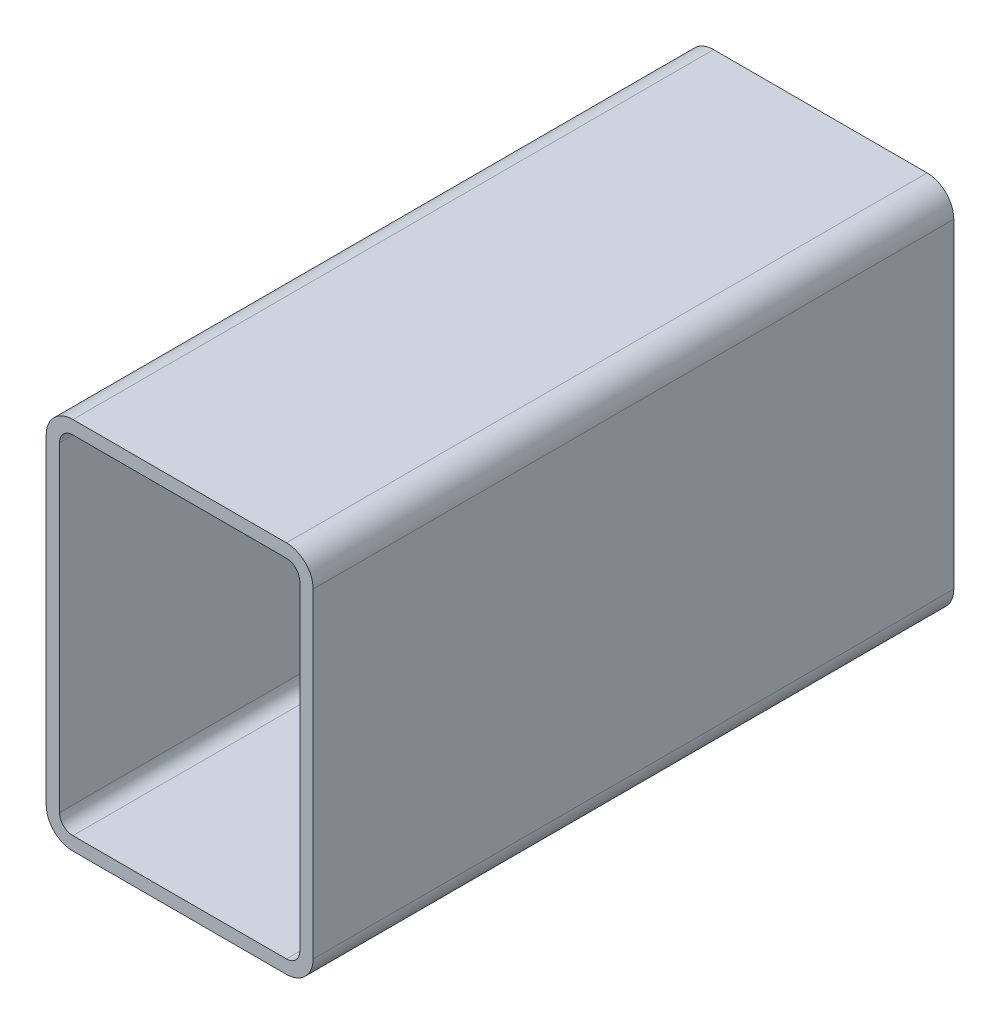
ISO-10303-21;
HEADER;
FILE_DESCRIPTION(('STEP AP214'),'2;1');
FILE_NAME('part.step','',(''),(''),'','','');
FILE_SCHEMA(('AUTOMOTIVE_DESIGN { 1 0 10303 214 1 1 1 1 }'));
ENDSEC;
DATA;
#1=APPLICATION_CONTEXT('core data for automotive mechanical design processes');
#2=APPLICATION_PROTOCOL_DEFINITION('international standard','automotive_design',2000,#1);
#3=PRODUCT_CONTEXT('',#1,'mechanical');
#4=PRODUCT('Part','Part','',(#3));
#5=PRODUCT_RELATED_PRODUCT_CATEGORY('part','',(#4));
#6=PRODUCT_DEFINITION_FORMATION('','',#4);
#7=PRODUCT_DEFINITION_CONTEXT('part definition',#1,'design');
#8=PRODUCT_DEFINITION('design','',#6,#7);
#9=PRODUCT_DEFINITION_SHAPE('','',#8);
#10=(LENGTH_UNIT() NAMED_UNIT(*) SI_UNIT(.MILLI.,.METRE.));
#11=(NAMED_UNIT(*) PLANE_ANGLE_UNIT() SI_UNIT($,.RADIAN.));
#12=(NAMED_UNIT(*) SI_UNIT($,.STERADIAN.) SOLID_ANGLE_UNIT());
#13=UNCERTAINTY_MEASURE_WITH_UNIT(LENGTH_MEASURE(1.E-05),#10,'distance_accuracy_value','');
#14=(GEOMETRIC_REPRESENTATION_CONTEXT(3) GLOBAL_UNCERTAINTY_ASSIGNED_CONTEXT((#13)) GLOBAL_UNIT_ASSIGNED_CONTEXT((#10,
#11,#12)) REPRESENTATION_CONTEXT('',''));
#15=CARTESIAN_POINT('',(0.,0.,0.));
#16=DIRECTION('',(0.,0.,1.));
#17=DIRECTION('',(1.,0.,0.));
#18=AXIS2_PLACEMENT_3D('',#15,#16,#17);
#19=CARTESIAN_POINT('',(13.5612396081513,167.089039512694,304.8));
#20=DIRECTION('',(0.,0.,1.));
#21=DIRECTION('',(1.,0.,0.));
#22=AXIS2_PLACEMENT_3D('',#19,#20,#21);
#23=PLANE('',#22);
#24=CARTESIAN_POINT('',(13.5612396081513,167.089039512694,304.8));
#25=DIRECTION('',(0.,0.,1.));
#26=DIRECTION('',(1.,0.,0.));
#27=AXIS2_PLACEMENT_3D('',#24,#25,#26);
#28=CIRCLE('',#27,12.7);
#29=CARTESIAN_POINT('',(13.5612396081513,179.789039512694,304.8));
#30=VERTEX_POINT('',#29);
#31=CARTESIAN_POINT('',(0.8612396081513,167.089039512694,304.8));
#32=VERTEX_POINT('',#31);
#33=EDGE_CURVE('E211',#30,#32,#28,.T.);
#34=ORIENTED_EDGE('',*,*,#33,.T.);
#35=DIRECTION('',(0.,-1.,0.));
#36=VECTOR('',#35,1.);
#37=CARTESIAN_POINT('',(0.8612396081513,14.6890395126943,304.8));
#38=LINE('',#37,#36);
#39=CARTESIAN_POINT('',(0.8612396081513,14.6890395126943,304.8));
#40=VERTEX_POINT('',#39);
#41=EDGE_CURVE('E214',#32,#40,#38,.T.);
#42=ORIENTED_EDGE('',*,*,#41,.T.);
#43=CARTESIAN_POINT('',(13.5612396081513,14.6890395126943,304.8));
#44=DIRECTION('',(0.,0.,1.));
#45=DIRECTION('',(1.,0.,0.));
#46=AXIS2_PLACEMENT_3D('',#43,#44,#45);
#47=CIRCLE('',#46,12.7);
#48=CARTESIAN_POINT('',(13.5612396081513,1.98903951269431,304.8));
#49=VERTEX_POINT('',#48);
#50=EDGE_CURVE('E217',#40,#49,#47,.T.);
#51=ORIENTED_EDGE('',*,*,#50,.T.);
#52=DIRECTION('',(1.,0.,0.));
#53=VECTOR('',#52,1.);
#54=CARTESIAN_POINT('',(115.161239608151,1.98903951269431,304.8));
#55=LINE('',#54,#53);
#56=CARTESIAN_POINT('',(115.161239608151,1.98903951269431,304.8));
#57=VERTEX_POINT('',#56);
#58=EDGE_CURVE('E219',#49,#57,#55,.T.);
#59=ORIENTED_EDGE('',*,*,#58,.T.);
#60=CARTESIAN_POINT('',(115.161239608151,14.6890395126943,304.8));
#61=DIRECTION('',(0.,0.,1.));
#62=DIRECTION('',(1.,0.,0.));
#63=AXIS2_PLACEMENT_3D('',#60,#61,#62);
#64=CIRCLE('',#63,12.7);
#65=CARTESIAN_POINT('',(127.861239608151,14.6890395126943,304.8));
#66=VERTEX_POINT('',#65);
#67=EDGE_CURVE('E221',#57,#66,#64,.T.);
#68=ORIENTED_EDGE('',*,*,#67,.T.);
#69=DIRECTION('',(0.,1.,0.));
#70=VECTOR('',#69,1.);
#71=CARTESIAN_POINT('',(127.861239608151,167.089039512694,304.8));
#72=LINE('',#71,#70);
#73=CARTESIAN_POINT('',(127.861239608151,167.089039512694,304.8));
#74=VERTEX_POINT('',#73);
#75=EDGE_CURVE('E223',#66,#74,#72,.T.);
#76=ORIENTED_EDGE('',*,*,#75,.T.);
#77=CARTESIAN_POINT('',(115.161239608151,167.089039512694,304.8));
#78=DIRECTION('',(0.,0.,1.));
#79=DIRECTION('',(1.,0.,0.));
#80=AXIS2_PLACEMENT_3D('',#77,#78,#79);
#81=CIRCLE('',#80,12.7);
#82=CARTESIAN_POINT('',(115.161239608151,179.789039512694,304.8));
#83=VERTEX_POINT('',#82);
#84=EDGE_CURVE('E225',#74,#83,#81,.T.);
#85=ORIENTED_EDGE('',*,*,#84,.T.);
#86=DIRECTION('',(-1.,0.,0.));
#87=VECTOR('',#86,1.);
#88=CARTESIAN_POINT('',(13.5612396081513,179.789039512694,304.8));
#89=LINE('',#88,#87);
#90=EDGE_CURVE('E227',#83,#30,#89,.T.);
#91=ORIENTED_EDGE('',*,*,#90,.T.);
#92=EDGE_LOOP('',(#34,#42,#51,#59,#68,#76,#85,#91));
#93=FACE_BOUND('',#92,.T.);
#94=DIRECTION('',(0.,-1.,0.));
#95=VECTOR('',#94,1.);
#96=CARTESIAN_POINT('',(7.2112396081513,14.6890395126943,304.8));
#97=LINE('',#96,#95);
#98=CARTESIAN_POINT('',(7.2112396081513,167.089039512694,304.8));
#99=VERTEX_POINT('',#98);
#100=CARTESIAN_POINT('',(7.2112396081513,14.6890395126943,304.8));
#101=VERTEX_POINT('',#100);
#102=EDGE_CURVE('E154',#99,#101,#97,.T.);
#103=ORIENTED_EDGE('',*,*,#102,.F.);
#104=CARTESIAN_POINT('',(13.5612396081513,167.089039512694,304.8));
#105=DIRECTION('',(0.,0.,1.));
#106=DIRECTION('',(1.,0.,0.));
#107=AXIS2_PLACEMENT_3D('',#104,#105,#106);
#108=CIRCLE('',#107,6.34999999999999);
#109=CARTESIAN_POINT('',(13.5612396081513,173.439039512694,304.8));
#110=VERTEX_POINT('',#109);
#111=EDGE_CURVE('E146',#110,#99,#108,.T.);
#112=ORIENTED_EDGE('',*,*,#111,.F.);
#113=DIRECTION('',(-1.,0.,0.));
#114=VECTOR('',#113,1.);
#115=CARTESIAN_POINT('',(13.5612396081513,173.439039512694,304.8));
#116=LINE('',#115,#114);
#117=CARTESIAN_POINT('',(115.161239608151,173.439039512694,304.8));
#118=VERTEX_POINT('',#117);
#119=EDGE_CURVE('E179',#118,#110,#116,.T.);
#120=ORIENTED_EDGE('',*,*,#119,.F.);
#121=CARTESIAN_POINT('',(115.161239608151,167.089039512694,304.8));
#122=DIRECTION('',(0.,0.,1.));
#123=DIRECTION('',(1.,0.,0.));
#124=AXIS2_PLACEMENT_3D('',#121,#122,#123);
#125=CIRCLE('',#124,6.35);
#126=CARTESIAN_POINT('',(121.511239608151,167.089039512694,304.8));
#127=VERTEX_POINT('',#126);
#128=EDGE_CURVE('E177',#127,#118,#125,.T.);
#129=ORIENTED_EDGE('',*,*,#128,.F.);
#130=DIRECTION('',(0.,1.,0.));
#131=VECTOR('',#130,1.);
#132=CARTESIAN_POINT('',(121.511239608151,167.089039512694,304.8));
#133=LINE('',#132,#131);
#134=CARTESIAN_POINT('',(121.511239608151,14.6890395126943,304.8));
#135=VERTEX_POINT('',#134);
#136=EDGE_CURVE('E175',#135,#127,#133,.T.);
#137=ORIENTED_EDGE('',*,*,#136,.F.);
#138=CARTESIAN_POINT('',(115.161239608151,14.6890395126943,304.8));
#139=DIRECTION('',(0.,0.,1.));
#140=DIRECTION('',(1.,0.,0.));
#141=AXIS2_PLACEMENT_3D('',#138,#139,#140);
#142=CIRCLE('',#141,6.35000000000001);
#143=CARTESIAN_POINT('',(115.161239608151,8.3390395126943,304.8));
#144=VERTEX_POINT('',#143);
#145=EDGE_CURVE('E173',#144,#135,#142,.T.);
#146=ORIENTED_EDGE('',*,*,#145,.F.);
#147=DIRECTION('',(1.,0.,0.));
#148=VECTOR('',#147,1.);
#149=CARTESIAN_POINT('',(115.161239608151,8.33903951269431,304.8));
#150=LINE('',#149,#148);
#151=CARTESIAN_POINT('',(13.5612396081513,8.33903951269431,304.8));
#152=VERTEX_POINT('',#151);
#153=EDGE_CURVE('E169',#152,#144,#150,.T.);
#154=ORIENTED_EDGE('',*,*,#153,.F.);
#155=CARTESIAN_POINT('',(13.5612396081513,14.6890395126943,304.8));
#156=DIRECTION('',(0.,0.,1.));
#157=DIRECTION('',(1.,0.,0.));
#158=AXIS2_PLACEMENT_3D('',#155,#156,#157);
#159=CIRCLE('',#158,6.35);
#160=EDGE_CURVE('E167',#101,#152,#159,.T.);
#161=ORIENTED_EDGE('',*,*,#160,.F.);
#162=EDGE_LOOP('',(#103,#112,#120,#129,#137,#146,#154,#161));
#163=FACE_BOUND('',#162,.T.);
#164=ADVANCED_FACE('F33',(#93,#163),#23,.T.);
#165=CARTESIAN_POINT('',(13.5612396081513,167.089039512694,0.));
#166=DIRECTION('',(0.,0.,1.));
#167=DIRECTION('',(1.,0.,0.));
#168=AXIS2_PLACEMENT_3D('',#165,#166,#167);
#169=PLANE('',#168);
#170=CARTESIAN_POINT('',(13.5612396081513,167.089039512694,0.));
#171=DIRECTION('',(0.,0.,1.));
#172=DIRECTION('',(1.,0.,0.));
#173=AXIS2_PLACEMENT_3D('',#170,#171,#172);
#174=CIRCLE('',#173,12.7);
#175=CARTESIAN_POINT('',(13.5612396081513,179.789039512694,0.));
#176=VERTEX_POINT('',#175);
#177=CARTESIAN_POINT('',(0.8612396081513,167.089039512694,0.));
#178=VERTEX_POINT('',#177);
#179=EDGE_CURVE('E162',#176,#178,#174,.T.);
#180=ORIENTED_EDGE('',*,*,#179,.F.);
#181=DIRECTION('',(-1.,0.,0.));
#182=VECTOR('',#181,1.);
#183=CARTESIAN_POINT('',(13.5612396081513,179.789039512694,0.));
#184=LINE('',#183,#182);
#185=CARTESIAN_POINT('',(115.161239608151,179.789039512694,0.));
#186=VERTEX_POINT('',#185);
#187=EDGE_CURVE('E215',#186,#176,#184,.T.);
#188=ORIENTED_EDGE('',*,*,#187,.F.);
#189=CARTESIAN_POINT('',(115.161239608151,167.089039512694,0.));
#190=DIRECTION('',(0.,0.,1.));
#191=DIRECTION('',(1.,0.,0.));
#192=AXIS2_PLACEMENT_3D('',#189,#190,#191);
#193=CIRCLE('',#192,12.7);
#194=CARTESIAN_POINT('',(127.861239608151,167.089039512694,0.));
#195=VERTEX_POINT('',#194);
#196=EDGE_CURVE('E242',#195,#186,#193,.T.);
#197=ORIENTED_EDGE('',*,*,#196,.F.);
#198=DIRECTION('',(0.,1.,0.));
#199=VECTOR('',#198,1.);
#200=CARTESIAN_POINT('',(127.861239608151,167.089039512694,0.));
#201=LINE('',#200,#199);
#202=CARTESIAN_POINT('',(127.861239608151,14.6890395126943,0.));
#203=VERTEX_POINT('',#202);
#204=EDGE_CURVE('E240',#203,#195,#201,.T.);
#205=ORIENTED_EDGE('',*,*,#204,.F.);
#206=CARTESIAN_POINT('',(115.161239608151,14.6890395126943,0.));
#207=DIRECTION('',(0.,0.,1.));
#208=DIRECTION('',(1.,0.,0.));
#209=AXIS2_PLACEMENT_3D('',#206,#207,#208);
#210=CIRCLE('',#209,12.7);
#211=CARTESIAN_POINT('',(115.161239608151,1.98903951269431,0.));
#212=VERTEX_POINT('',#211);
#213=EDGE_CURVE('E238',#212,#203,#210,.T.);
#214=ORIENTED_EDGE('',*,*,#213,.F.);
#215=DIRECTION('',(1.,0.,0.));
#216=VECTOR('',#215,1.);
#217=CARTESIAN_POINT('',(115.161239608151,1.98903951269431,0.));
#218=LINE('',#217,#216);
#219=CARTESIAN_POINT('',(13.5612396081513,1.98903951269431,0.));
#220=VERTEX_POINT('',#219);
#221=EDGE_CURVE('E236',#220,#212,#218,.T.);
#222=ORIENTED_EDGE('',*,*,#221,.F.);
#223=CARTESIAN_POINT('',(13.5612396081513,14.6890395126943,0.));
#224=DIRECTION('',(0.,0.,1.));
#225=DIRECTION('',(1.,0.,0.));
#226=AXIS2_PLACEMENT_3D('',#223,#224,#225);
#227=CIRCLE('',#226,12.7);
#228=CARTESIAN_POINT('',(0.8612396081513,14.6890395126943,0.));
#229=VERTEX_POINT('',#228);
#230=EDGE_CURVE('E234',#229,#220,#227,.T.);
#231=ORIENTED_EDGE('',*,*,#230,.F.);
#232=DIRECTION('',(0.,-1.,0.));
#233=VECTOR('',#232,1.);
#234=CARTESIAN_POINT('',(0.8612396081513,14.6890395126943,0.));
#235=LINE('',#234,#233);
#236=EDGE_CURVE('E232',#178,#229,#235,.T.);
#237=ORIENTED_EDGE('',*,*,#236,.F.);
#238=EDGE_LOOP('',(#180,#188,#197,#205,#214,#222,#231,#237));
#239=FACE_BOUND('',#238,.T.);
#240=CARTESIAN_POINT('',(13.5612396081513,167.089039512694,0.));
#241=DIRECTION('',(0.,0.,1.));
#242=DIRECTION('',(1.,0.,0.));
#243=AXIS2_PLACEMENT_3D('',#240,#241,#242);
#244=CIRCLE('',#243,6.34999999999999);
#245=CARTESIAN_POINT('',(13.5612396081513,173.439039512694,0.));
#246=VERTEX_POINT('',#245);
#247=CARTESIAN_POINT('',(7.2112396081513,167.089039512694,0.));
#248=VERTEX_POINT('',#247);
#249=EDGE_CURVE('E56',#246,#248,#244,.T.);
#250=ORIENTED_EDGE('',*,*,#249,.T.);
#251=DIRECTION('',(0.,-1.,0.));
#252=VECTOR('',#251,1.);
#253=CARTESIAN_POINT('',(7.2112396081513,14.6890395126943,0.));
#254=LINE('',#253,#252);
#255=CARTESIAN_POINT('',(7.2112396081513,14.6890395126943,0.));
#256=VERTEX_POINT('',#255);
#257=EDGE_CURVE('E161',#248,#256,#254,.T.);
#258=ORIENTED_EDGE('',*,*,#257,.T.);
#259=CARTESIAN_POINT('',(13.5612396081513,14.6890395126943,0.));
#260=DIRECTION('',(0.,0.,1.));
#261=DIRECTION('',(1.,0.,0.));
#262=AXIS2_PLACEMENT_3D('',#259,#260,#261);
#263=CIRCLE('',#262,6.35);
#264=CARTESIAN_POINT('',(13.5612396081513,8.33903951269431,0.));
#265=VERTEX_POINT('',#264);
#266=EDGE_CURVE('E183',#256,#265,#263,.T.);
#267=ORIENTED_EDGE('',*,*,#266,.T.);
#268=DIRECTION('',(1.,0.,0.));
#269=VECTOR('',#268,1.);
#270=CARTESIAN_POINT('',(115.161239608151,8.33903951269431,0.));
#271=LINE('',#270,#269);
#272=CARTESIAN_POINT('',(115.161239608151,8.3390395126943,0.));
#273=VERTEX_POINT('',#272);
#274=EDGE_CURVE('E186',#265,#273,#271,.T.);
#275=ORIENTED_EDGE('',*,*,#274,.T.);
#276=CARTESIAN_POINT('',(115.161239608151,14.6890395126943,0.));
#277=DIRECTION('',(0.,0.,1.));
#278=DIRECTION('',(1.,0.,0.));
#279=AXIS2_PLACEMENT_3D('',#276,#277,#278);
#280=CIRCLE('',#279,6.35000000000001);
#281=CARTESIAN_POINT('',(121.511239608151,14.6890395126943,0.));
#282=VERTEX_POINT('',#281);
#283=EDGE_CURVE('E189',#273,#282,#280,.T.);
#284=ORIENTED_EDGE('',*,*,#283,.T.);
#285=DIRECTION('',(0.,1.,0.));
#286=VECTOR('',#285,1.);
#287=CARTESIAN_POINT('',(121.511239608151,167.089039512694,0.));
#288=LINE('',#287,#286);
#289=CARTESIAN_POINT('',(121.511239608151,167.089039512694,0.));
#290=VERTEX_POINT('',#289);
#291=EDGE_CURVE('E192',#282,#290,#288,.T.);
#292=ORIENTED_EDGE('',*,*,#291,.T.);
#293=CARTESIAN_POINT('',(115.161239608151,167.089039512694,0.));
#294=DIRECTION('',(0.,0.,1.));
#295=DIRECTION('',(1.,0.,0.));
#296=AXIS2_PLACEMENT_3D('',#293,#294,#295);
#297=CIRCLE('',#296,6.35);
#298=CARTESIAN_POINT('',(115.161239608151,173.439039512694,0.));
#299=VERTEX_POINT('',#298);
#300=EDGE_CURVE('E195',#290,#299,#297,.T.);
#301=ORIENTED_EDGE('',*,*,#300,.T.);
#302=DIRECTION('',(-1.,0.,0.));
#303=VECTOR('',#302,1.);
#304=CARTESIAN_POINT('',(13.5612396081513,173.439039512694,0.));
#305=LINE('',#304,#303);
#306=EDGE_CURVE('E155',#299,#246,#305,.T.);
#307=ORIENTED_EDGE('',*,*,#306,.T.);
#308=EDGE_LOOP('',(#250,#258,#267,#275,#284,#292,#301,#307));
#309=FACE_BOUND('',#308,.T.);
#310=ADVANCED_FACE('F272',(#239,#309),#169,.F.);
#311=CARTESIAN_POINT('',(13.5612396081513,167.089039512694,304.8));
#312=DIRECTION('',(0.,0.,-1.));
#313=DIRECTION('',(-1.,0.,0.));
#314=AXIS2_PLACEMENT_3D('',#311,#312,#313);
#315=CYLINDRICAL_SURFACE('',#314,12.7);
#316=ORIENTED_EDGE('',*,*,#179,.T.);
#317=DIRECTION('',(0.,0.,-1.));
#318=VECTOR('',#317,1.);
#319=CARTESIAN_POINT('',(0.8612396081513,167.089039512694,304.8));
#320=LINE('',#319,#318);
#321=EDGE_CURVE('E11',#32,#178,#320,.T.);
#322=ORIENTED_EDGE('',*,*,#321,.F.);
#323=ORIENTED_EDGE('',*,*,#33,.F.);
#324=DIRECTION('',(0.,0.,-1.));
#325=VECTOR('',#324,1.);
#326=CARTESIAN_POINT('',(13.5612396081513,179.789039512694,304.8));
#327=LINE('',#326,#325);
#328=EDGE_CURVE('E229',#30,#176,#327,.T.);
#329=ORIENTED_EDGE('',*,*,#328,.T.);
#330=EDGE_LOOP('',(#316,#322,#323,#329));
#331=FACE_BOUND('',#330,.T.);
#332=ADVANCED_FACE('F35',(#331),#315,.T.);
#333=CARTESIAN_POINT('',(0.8612396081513,14.6890395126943,304.8));
#334=DIRECTION('',(1.,0.,0.));
#335=DIRECTION('',(0.,0.,-1.));
#336=AXIS2_PLACEMENT_3D('',#333,#334,#335);
#337=PLANE('',#336);
#338=ORIENTED_EDGE('',*,*,#236,.T.);
#339=DIRECTION('',(0.,0.,-1.));
#340=VECTOR('',#339,1.);
#341=CARTESIAN_POINT('',(0.8612396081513,14.6890395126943,304.8));
#342=LINE('',#341,#340);
#343=EDGE_CURVE('E41',#40,#229,#342,.T.);
#344=ORIENTED_EDGE('',*,*,#343,.F.);
#345=ORIENTED_EDGE('',*,*,#41,.F.);
#346=ORIENTED_EDGE('',*,*,#321,.T.);
#347=EDGE_LOOP('',(#338,#344,#345,#346));
#348=FACE_BOUND('',#347,.T.);
#349=ADVANCED_FACE('F289',(#348),#337,.F.);
#350=CARTESIAN_POINT('',(13.5612396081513,14.6890395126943,304.8));
#351=DIRECTION('',(0.,0.,-1.));
#352=DIRECTION('',(-1.,0.,0.));
#353=AXIS2_PLACEMENT_3D('',#350,#351,#352);
#354=CYLINDRICAL_SURFACE('',#353,12.7);
#355=ORIENTED_EDGE('',*,*,#230,.T.);
#356=DIRECTION('',(0.,0.,-1.));
#357=VECTOR('',#356,1.);
#358=CARTESIAN_POINT('',(13.5612396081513,1.98903951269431,304.8));
#359=LINE('',#358,#357);
#360=EDGE_CURVE('E259',#49,#220,#359,.T.);
#361=ORIENTED_EDGE('',*,*,#360,.F.);
#362=ORIENTED_EDGE('',*,*,#50,.F.);
#363=ORIENTED_EDGE('',*,*,#343,.T.);
#364=EDGE_LOOP('',(#355,#361,#362,#363));
#365=FACE_BOUND('',#364,.T.);
#366=ADVANCED_FACE('F266',(#365),#354,.T.);
#367=CARTESIAN_POINT('',(115.161239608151,1.98903951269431,304.8));
#368=DIRECTION('',(0.,1.,0.));
#369=DIRECTION('',(0.,0.,1.));
#370=AXIS2_PLACEMENT_3D('',#367,#368,#369);
#371=PLANE('',#370);
#372=ORIENTED_EDGE('',*,*,#221,.T.);
#373=DIRECTION('',(0.,0.,-1.));
#374=VECTOR('',#373,1.);
#375=CARTESIAN_POINT('',(115.161239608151,1.98903951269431,304.8));
#376=LINE('',#375,#374);
#377=EDGE_CURVE('E256',#57,#212,#376,.T.);
#378=ORIENTED_EDGE('',*,*,#377,.F.);
#379=ORIENTED_EDGE('',*,*,#58,.F.);
#380=ORIENTED_EDGE('',*,*,#360,.T.);
#381=EDGE_LOOP('',(#372,#378,#379,#380));
#382=FACE_BOUND('',#381,.T.);
#383=ADVANCED_FACE('F278',(#382),#371,.F.);
#384=CARTESIAN_POINT('',(115.161239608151,14.6890395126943,304.8));
#385=DIRECTION('',(0.,0.,-1.));
#386=DIRECTION('',(-1.,0.,0.));
#387=AXIS2_PLACEMENT_3D('',#384,#385,#386);
#388=CYLINDRICAL_SURFACE('',#387,12.7);
#389=ORIENTED_EDGE('',*,*,#213,.T.);
#390=DIRECTION('',(0.,0.,-1.));
#391=VECTOR('',#390,1.);
#392=CARTESIAN_POINT('',(127.861239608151,14.6890395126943,304.8));
#393=LINE('',#392,#391);
#394=EDGE_CURVE('E253',#66,#203,#393,.T.);
#395=ORIENTED_EDGE('',*,*,#394,.F.);
#396=ORIENTED_EDGE('',*,*,#67,.F.);
#397=ORIENTED_EDGE('',*,*,#377,.T.);
#398=EDGE_LOOP('',(#389,#395,#396,#397));
#399=FACE_BOUND('',#398,.T.);
#400=ADVANCED_FACE('F282',(#399),#388,.T.);
#401=CARTESIAN_POINT('',(127.861239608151,167.089039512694,304.8));
#402=DIRECTION('',(-1.,0.,0.));
#403=DIRECTION('',(0.,0.,1.));
#404=AXIS2_PLACEMENT_3D('',#401,#402,#403);
#405=PLANE('',#404);
#406=ORIENTED_EDGE('',*,*,#204,.T.);
#407=DIRECTION('',(0.,0.,-1.));
#408=VECTOR('',#407,1.);
#409=CARTESIAN_POINT('',(127.861239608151,167.089039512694,304.8));
#410=LINE('',#409,#408);
#411=EDGE_CURVE('E250',#74,#195,#410,.T.);
#412=ORIENTED_EDGE('',*,*,#411,.F.);
#413=ORIENTED_EDGE('',*,*,#75,.F.);
#414=ORIENTED_EDGE('',*,*,#394,.T.);
#415=EDGE_LOOP('',(#406,#412,#413,#414));
#416=FACE_BOUND('',#415,.T.);
#417=ADVANCED_FACE('F302',(#416),#405,.F.);
#418=CARTESIAN_POINT('',(115.161239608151,167.089039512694,304.8));
#419=DIRECTION('',(0.,0.,-1.));
#420=DIRECTION('',(-1.,0.,0.));
#421=AXIS2_PLACEMENT_3D('',#418,#419,#420);
#422=CYLINDRICAL_SURFACE('',#421,12.7);
#423=ORIENTED_EDGE('',*,*,#196,.T.);
#424=DIRECTION('',(0.,0.,-1.));
#425=VECTOR('',#424,1.);
#426=CARTESIAN_POINT('',(115.161239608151,179.789039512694,304.8));
#427=LINE('',#426,#425);
#428=EDGE_CURVE('E247',#83,#186,#427,.T.);
#429=ORIENTED_EDGE('',*,*,#428,.F.);
#430=ORIENTED_EDGE('',*,*,#84,.F.);
#431=ORIENTED_EDGE('',*,*,#411,.T.);
#432=EDGE_LOOP('',(#423,#429,#430,#431));
#433=FACE_BOUND('',#432,.T.);
#434=ADVANCED_FACE('F300',(#433),#422,.T.);
#435=CARTESIAN_POINT('',(13.5612396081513,179.789039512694,304.8));
#436=DIRECTION('',(0.,-1.,0.));
#437=DIRECTION('',(0.,0.,-1.));
#438=AXIS2_PLACEMENT_3D('',#435,#436,#437);
#439=PLANE('',#438);
#440=ORIENTED_EDGE('',*,*,#187,.T.);
#441=ORIENTED_EDGE('',*,*,#328,.F.);
#442=ORIENTED_EDGE('',*,*,#90,.F.);
#443=ORIENTED_EDGE('',*,*,#428,.T.);
#444=EDGE_LOOP('',(#440,#441,#442,#443));
#445=FACE_BOUND('',#444,.T.);
#446=ADVANCED_FACE('F295',(#445),#439,.F.);
#447=CARTESIAN_POINT('',(13.5612396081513,167.089039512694,304.8));
#448=DIRECTION('',(0.,0.,-1.));
#449=DIRECTION('',(-1.,0.,0.));
#450=AXIS2_PLACEMENT_3D('',#447,#448,#449);
#451=CYLINDRICAL_SURFACE('',#450,6.34999999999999);
#452=ORIENTED_EDGE('',*,*,#249,.F.);
#453=DIRECTION('',(0.,0.,-1.));
#454=VECTOR('',#453,1.);
#455=CARTESIAN_POINT('',(13.5612396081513,173.439039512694,304.8));
#456=LINE('',#455,#454);
#457=EDGE_CURVE('E150',#110,#246,#456,.T.);
#458=ORIENTED_EDGE('',*,*,#457,.F.);
#459=ORIENTED_EDGE('',*,*,#111,.T.);
#460=DIRECTION('',(0.,0.,-1.));
#461=VECTOR('',#460,1.);
#462=CARTESIAN_POINT('',(7.2112396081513,167.089039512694,304.8));
#463=LINE('',#462,#461);
#464=EDGE_CURVE('E149',#99,#248,#463,.T.);
#465=ORIENTED_EDGE('',*,*,#464,.T.);
#466=EDGE_LOOP('',(#452,#458,#459,#465));
#467=FACE_BOUND('',#466,.T.);
#468=ADVANCED_FACE('F148',(#467),#451,.F.);
#469=CARTESIAN_POINT('',(7.2112396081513,14.6890395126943,304.8));
#470=DIRECTION('',(1.,0.,0.));
#471=DIRECTION('',(0.,0.,-1.));
#472=AXIS2_PLACEMENT_3D('',#469,#470,#471);
#473=PLANE('',#472);
#474=ORIENTED_EDGE('',*,*,#257,.F.);
#475=ORIENTED_EDGE('',*,*,#464,.F.);
#476=ORIENTED_EDGE('',*,*,#102,.T.);
#477=DIRECTION('',(0.,0.,-1.));
#478=VECTOR('',#477,1.);
#479=CARTESIAN_POINT('',(7.2112396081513,14.6890395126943,304.8));
#480=LINE('',#479,#478);
#481=EDGE_CURVE('E163',#101,#256,#480,.T.);
#482=ORIENTED_EDGE('',*,*,#481,.T.);
#483=EDGE_LOOP('',(#474,#475,#476,#482));
#484=FACE_BOUND('',#483,.T.);
#485=ADVANCED_FACE('F158',(#484),#473,.T.);
#486=CARTESIAN_POINT('',(13.5612396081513,14.6890395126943,304.8));
#487=DIRECTION('',(0.,0.,-1.));
#488=DIRECTION('',(-1.,0.,0.));
#489=AXIS2_PLACEMENT_3D('',#486,#487,#488);
#490=CYLINDRICAL_SURFACE('',#489,6.35);
#491=ORIENTED_EDGE('',*,*,#266,.F.);
#492=ORIENTED_EDGE('',*,*,#481,.F.);
#493=ORIENTED_EDGE('',*,*,#160,.T.);
#494=DIRECTION('',(0.,0.,-1.));
#495=VECTOR('',#494,1.);
#496=CARTESIAN_POINT('',(13.5612396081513,8.33903951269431,304.8));
#497=LINE('',#496,#495);
#498=EDGE_CURVE('E208',#152,#265,#497,.T.);
#499=ORIENTED_EDGE('',*,*,#498,.T.);
#500=EDGE_LOOP('',(#491,#492,#493,#499));
#501=FACE_BOUND('',#500,.T.);
#502=ADVANCED_FACE('F327',(#501),#490,.F.);
#503=CARTESIAN_POINT('',(115.161239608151,8.33903951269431,304.8));
#504=DIRECTION('',(0.,1.,0.));
#505=DIRECTION('',(0.,0.,1.));
#506=AXIS2_PLACEMENT_3D('',#503,#504,#505);
#507=PLANE('',#506);
#508=ORIENTED_EDGE('',*,*,#274,.F.);
#509=ORIENTED_EDGE('',*,*,#498,.F.);
#510=ORIENTED_EDGE('',*,*,#153,.T.);
#511=DIRECTION('',(0.,0.,-1.));
#512=VECTOR('',#511,1.);
#513=CARTESIAN_POINT('',(115.161239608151,8.3390395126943,304.8));
#514=LINE('',#513,#512);
#515=EDGE_CURVE('E206',#144,#273,#514,.T.);
#516=ORIENTED_EDGE('',*,*,#515,.T.);
#517=EDGE_LOOP('',(#508,#509,#510,#516));
#518=FACE_BOUND('',#517,.T.);
#519=ADVANCED_FACE('F331',(#518),#507,.T.);
#520=CARTESIAN_POINT('',(115.161239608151,14.6890395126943,304.8));
#521=DIRECTION('',(0.,0.,-1.));
#522=DIRECTION('',(-1.,0.,0.));
#523=AXIS2_PLACEMENT_3D('',#520,#521,#522);
#524=CYLINDRICAL_SURFACE('',#523,6.35000000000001);
#525=ORIENTED_EDGE('',*,*,#283,.F.);
#526=ORIENTED_EDGE('',*,*,#515,.F.);
#527=ORIENTED_EDGE('',*,*,#145,.T.);
#528=DIRECTION('',(0.,0.,-1.));
#529=VECTOR('',#528,1.);
#530=CARTESIAN_POINT('',(121.511239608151,14.6890395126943,304.8));
#531=LINE('',#530,#529);
#532=EDGE_CURVE('E204',#135,#282,#531,.T.);
#533=ORIENTED_EDGE('',*,*,#532,.T.);
#534=EDGE_LOOP('',(#525,#526,#527,#533));
#535=FACE_BOUND('',#534,.T.);
#536=ADVANCED_FACE('F337',(#535),#524,.F.);
#537=CARTESIAN_POINT('',(121.511239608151,167.089039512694,304.8));
#538=DIRECTION('',(-1.,0.,0.));
#539=DIRECTION('',(0.,0.,1.));
#540=AXIS2_PLACEMENT_3D('',#537,#538,#539);
#541=PLANE('',#540);
#542=ORIENTED_EDGE('',*,*,#291,.F.);
#543=ORIENTED_EDGE('',*,*,#532,.F.);
#544=ORIENTED_EDGE('',*,*,#136,.T.);
#545=DIRECTION('',(0.,0.,-1.));
#546=VECTOR('',#545,1.);
#547=CARTESIAN_POINT('',(121.511239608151,167.089039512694,304.8));
#548=LINE('',#547,#546);
#549=EDGE_CURVE('E202',#127,#290,#548,.T.);
#550=ORIENTED_EDGE('',*,*,#549,.T.);
#551=EDGE_LOOP('',(#542,#543,#544,#550));
#552=FACE_BOUND('',#551,.T.);
#553=ADVANCED_FACE('F341',(#552),#541,.T.);
#554=CARTESIAN_POINT('',(115.161239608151,167.089039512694,304.8));
#555=DIRECTION('',(0.,0.,-1.));
#556=DIRECTION('',(-1.,0.,0.));
#557=AXIS2_PLACEMENT_3D('',#554,#555,#556);
#558=CYLINDRICAL_SURFACE('',#557,6.35);
#559=ORIENTED_EDGE('',*,*,#300,.F.);
#560=ORIENTED_EDGE('',*,*,#549,.F.);
#561=ORIENTED_EDGE('',*,*,#128,.T.);
#562=DIRECTION('',(0.,0.,-1.));
#563=VECTOR('',#562,1.);
#564=CARTESIAN_POINT('',(115.161239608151,173.439039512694,304.8));
#565=LINE('',#564,#563);
#566=EDGE_CURVE('E48',#118,#299,#565,.T.);
#567=ORIENTED_EDGE('',*,*,#566,.T.);
#568=EDGE_LOOP('',(#559,#560,#561,#567));
#569=FACE_BOUND('',#568,.T.);
#570=ADVANCED_FACE('F345',(#569),#558,.F.);
#571=CARTESIAN_POINT('',(13.5612396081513,173.439039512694,304.8));
#572=DIRECTION('',(0.,-1.,0.));
#573=DIRECTION('',(0.,0.,-1.));
#574=AXIS2_PLACEMENT_3D('',#571,#572,#573);
#575=PLANE('',#574);
#576=ORIENTED_EDGE('',*,*,#306,.F.);
#577=ORIENTED_EDGE('',*,*,#566,.F.);
#578=ORIENTED_EDGE('',*,*,#119,.T.);
#579=ORIENTED_EDGE('',*,*,#457,.T.);
#580=EDGE_LOOP('',(#576,#577,#578,#579));
#581=FACE_BOUND('',#580,.T.);
#582=ADVANCED_FACE('F349',(#581),#575,.T.);
#583=CLOSED_SHELL('',(#164,#310,#332,#349,#366,#383,#400,#417,#434,#446,#468,#485,#502,#519,
#536,#553,#570,#582));
#584=MANIFOLD_SOLID_BREP('B2',#583);
#585=ADVANCED_BREP_SHAPE_REPRESENTATION('',(#18,#584),#14);
#586=SHAPE_DEFINITION_REPRESENTATION(#9,#585);
ENDSEC;
END-ISO-10303-21;
